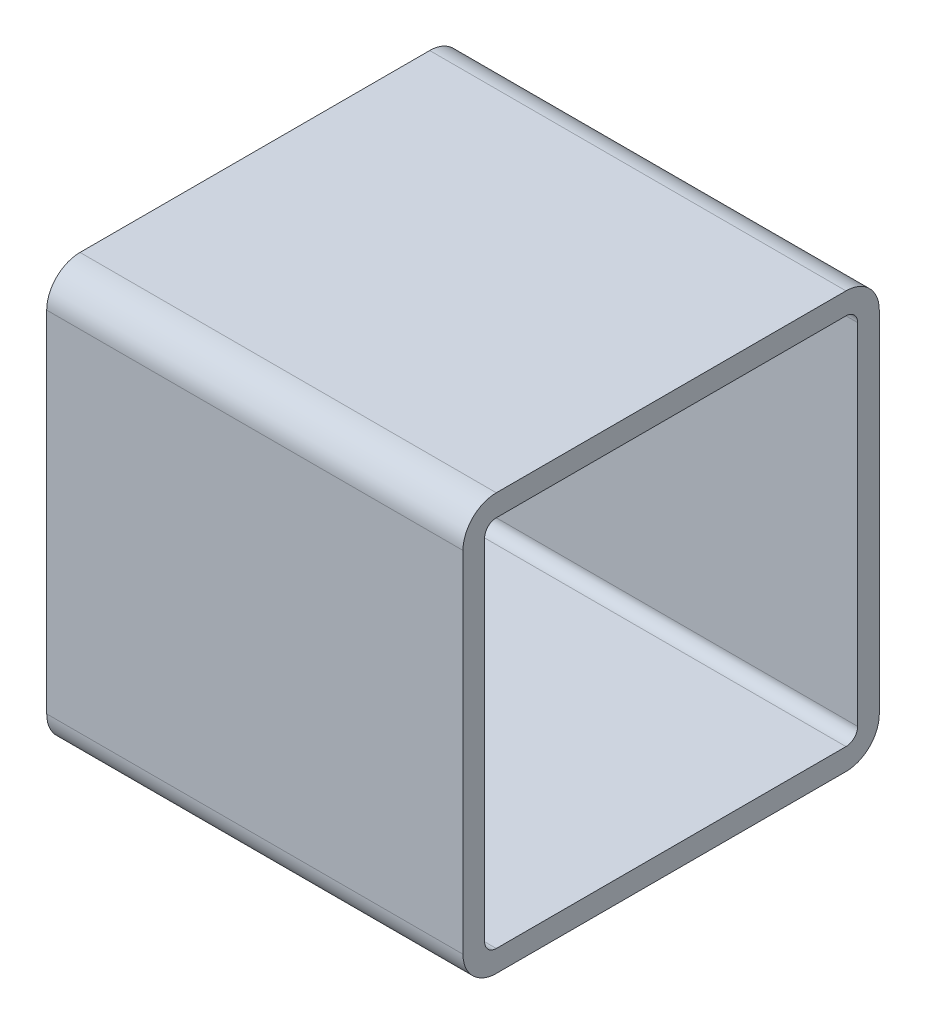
from build123d import *

# Parameters (mm, degrees)
BOSS_EXTRUDE1_DEPTH = 31.75


with BuildPart() as part:
    # Sketch1 → Boss-Extrude1 (new body)
    with BuildSketch(Plane(origin=(0, 0, 0), x_dir=(0, 0, -1), z_dir=(1, 0, 0))):
        with BuildLine():
            Line((0, 2.54), (0, 29.21))
            ThreePointArc((0, 29.21), (-0.743948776, 31.006051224), (-2.54, 31.75))
            Line((-2.54, 31.75), (-29.21, 31.75))
            ThreePointArc((-29.21, 31.75), (-31.006051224, 31.006051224), (-31.75, 29.21))
            Line((-31.75, 29.21), (-31.75, 2.54))
            ThreePointArc((-31.75, 2.54), (-31.006051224, 0.743948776), (-29.21, 0))
            Line((-29.21, 0), (-2.54, 0))
            ThreePointArc((-2.54, 0), (-0.743948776, 0.743948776), (0, 2.54))
        make_face()
        with BuildLine():
            Line((-1.651, 2.54), (-1.651, 29.21))
            ThreePointArc((-1.651, 29.21), (-1.911382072, 29.838617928), (-2.54, 30.099))
            Line((-2.54, 30.099), (-29.21, 30.099))
            ThreePointArc((-29.21, 30.099), (-29.838617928, 29.838617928), (-30.099, 29.21))
            Line((-30.099, 29.21), (-30.099, 2.54))
            ThreePointArc((-30.099, 2.54), (-29.838617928, 1.911382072), (-29.21, 1.651))
            Line((-29.21, 1.651), (-2.54, 1.651))
            ThreePointArc((-2.54, 1.651), (-1.911382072, 1.911382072), (-1.651, 2.54))
        make_face(mode=Mode.SUBTRACT)
    extrude(amount=BOSS_EXTRUDE1_DEPTH)


solid = part.part
